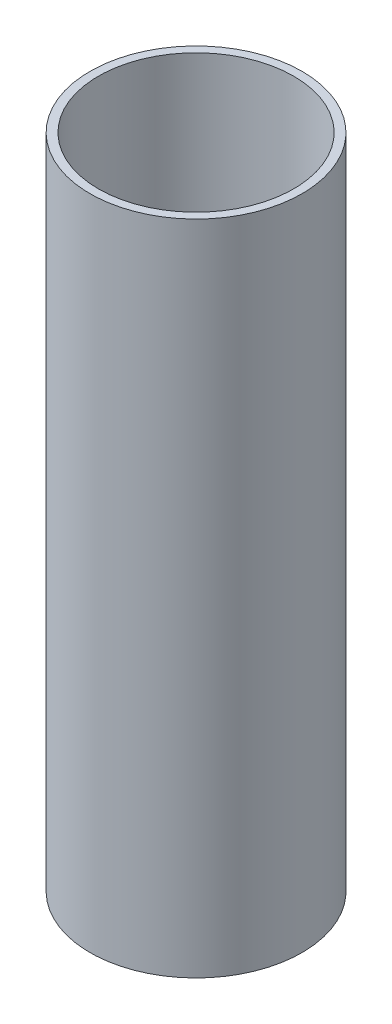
ISO-10303-21;
HEADER;
FILE_DESCRIPTION(('STEP AP214'),'2;1');
FILE_NAME('part.step','',(''),(''),'','','');
FILE_SCHEMA(('AUTOMOTIVE_DESIGN { 1 0 10303 214 1 1 1 1 }'));
ENDSEC;
DATA;
#1=APPLICATION_CONTEXT('core data for automotive mechanical design processes');
#2=APPLICATION_PROTOCOL_DEFINITION('international standard','automotive_design',2000,#1);
#3=PRODUCT_CONTEXT('',#1,'mechanical');
#4=PRODUCT('Part','Part','',(#3));
#5=PRODUCT_RELATED_PRODUCT_CATEGORY('part','',(#4));
#6=PRODUCT_DEFINITION_FORMATION('','',#4);
#7=PRODUCT_DEFINITION_CONTEXT('part definition',#1,'design');
#8=PRODUCT_DEFINITION('design','',#6,#7);
#9=PRODUCT_DEFINITION_SHAPE('','',#8);
#10=(LENGTH_UNIT() NAMED_UNIT(*) SI_UNIT(.MILLI.,.METRE.));
#11=(NAMED_UNIT(*) PLANE_ANGLE_UNIT() SI_UNIT($,.RADIAN.));
#12=(NAMED_UNIT(*) SI_UNIT($,.STERADIAN.) SOLID_ANGLE_UNIT());
#13=UNCERTAINTY_MEASURE_WITH_UNIT(LENGTH_MEASURE(1.E-05),#10,'distance_accuracy_value','');
#14=(GEOMETRIC_REPRESENTATION_CONTEXT(3) GLOBAL_UNCERTAINTY_ASSIGNED_CONTEXT((#13)) GLOBAL_UNIT_ASSIGNED_CONTEXT((#10,
#11,#12)) REPRESENTATION_CONTEXT('',''));
#15=CARTESIAN_POINT('',(0.,0.,0.));
#16=DIRECTION('',(0.,0.,1.));
#17=DIRECTION('',(1.,0.,0.));
#18=AXIS2_PLACEMENT_3D('',#15,#16,#17);
#19=CARTESIAN_POINT('',(0.,234.608624,0.));
#20=DIRECTION('',(0.,1.,0.));
#21=DIRECTION('',(0.,0.,1.));
#22=AXIS2_PLACEMENT_3D('',#19,#20,#21);
#23=PLANE('',#22);
#24=CARTESIAN_POINT('',(0.,234.608624,0.));
#25=DIRECTION('',(0.,1.,0.));
#26=DIRECTION('',(0.,0.,1.));
#27=AXIS2_PLACEMENT_3D('',#24,#25,#26);
#28=CIRCLE('',#27,37.846);
#29=CARTESIAN_POINT('',(0.,234.608624,-37.846));
#30=VERTEX_POINT('',#29);
#31=EDGE_CURVE('E10',#30,#30,#28,.T.);
#32=ORIENTED_EDGE('',*,*,#31,.T.);
#33=EDGE_LOOP('',(#32));
#34=FACE_BOUND('',#33,.T.);
#35=CARTESIAN_POINT('',(0.,234.608624,0.));
#36=DIRECTION('',(0.,1.,0.));
#37=DIRECTION('',(0.,0.,1.));
#38=AXIS2_PLACEMENT_3D('',#35,#36,#37);
#39=CIRCLE('',#38,34.8615);
#40=CARTESIAN_POINT('',(0.,234.608624,-34.8615));
#41=VERTEX_POINT('',#40);
#42=EDGE_CURVE('E55',#41,#41,#39,.T.);
#43=ORIENTED_EDGE('',*,*,#42,.F.);
#44=EDGE_LOOP('',(#43));
#45=FACE_BOUND('',#44,.T.);
#46=ADVANCED_FACE('F42',(#34,#45),#23,.T.);
#47=CARTESIAN_POINT('',(0.,0.,0.));
#48=DIRECTION('',(0.,1.,0.));
#49=DIRECTION('',(0.,0.,1.));
#50=AXIS2_PLACEMENT_3D('',#47,#48,#49);
#51=PLANE('',#50);
#52=CARTESIAN_POINT('',(0.,0.,0.));
#53=DIRECTION('',(0.,1.,0.));
#54=DIRECTION('',(0.,0.,1.));
#55=AXIS2_PLACEMENT_3D('',#52,#53,#54);
#56=CIRCLE('',#55,37.846);
#57=CARTESIAN_POINT('',(0.,0.,-37.846));
#58=VERTEX_POINT('',#57);
#59=EDGE_CURVE('E46',#58,#58,#56,.T.);
#60=ORIENTED_EDGE('',*,*,#59,.F.);
#61=EDGE_LOOP('',(#60));
#62=FACE_BOUND('',#61,.T.);
#63=CARTESIAN_POINT('',(0.,0.,0.));
#64=DIRECTION('',(0.,1.,0.));
#65=DIRECTION('',(0.,0.,1.));
#66=AXIS2_PLACEMENT_3D('',#63,#64,#65);
#67=CIRCLE('',#66,34.8615);
#68=CARTESIAN_POINT('',(0.,0.,-34.8615));
#69=VERTEX_POINT('',#68);
#70=EDGE_CURVE('E57',#69,#69,#67,.T.);
#71=ORIENTED_EDGE('',*,*,#70,.T.);
#72=EDGE_LOOP('',(#71));
#73=FACE_BOUND('',#72,.T.);
#74=ADVANCED_FACE('F69',(#62,#73),#51,.F.);
#75=CARTESIAN_POINT('',(0.,234.608624,0.));
#76=DIRECTION('',(0.,-1.,0.));
#77=DIRECTION('',(0.,0.,-1.));
#78=AXIS2_PLACEMENT_3D('',#75,#76,#77);
#79=CYLINDRICAL_SURFACE('',#78,37.846);
#80=CARTESIAN_POINT('',(0.,234.608624,-37.846));
#81=CARTESIAN_POINT('',(0.,232.164784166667,-37.846));
#82=CARTESIAN_POINT('',(0.,229.720944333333,-37.846));
#83=CARTESIAN_POINT('',(0.,224.833264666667,-37.846));
#84=CARTESIAN_POINT('',(0.,222.389424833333,-37.846));
#85=CARTESIAN_POINT('',(0.,217.501745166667,-37.846));
#86=CARTESIAN_POINT('',(0.,215.057905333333,-37.846));
#87=CARTESIAN_POINT('',(0.,210.170225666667,-37.846));
#88=CARTESIAN_POINT('',(0.,207.726385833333,-37.846));
#89=CARTESIAN_POINT('',(0.,202.838706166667,-37.846));
#90=CARTESIAN_POINT('',(0.,200.394866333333,-37.846));
#91=CARTESIAN_POINT('',(0.,195.507186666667,-37.846));
#92=CARTESIAN_POINT('',(0.,193.063346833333,-37.846));
#93=CARTESIAN_POINT('',(0.,188.175667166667,-37.846));
#94=CARTESIAN_POINT('',(0.,185.731827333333,-37.846));
#95=CARTESIAN_POINT('',(0.,180.844147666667,-37.846));
#96=CARTESIAN_POINT('',(0.,178.400307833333,-37.846));
#97=CARTESIAN_POINT('',(0.,173.512628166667,-37.846));
#98=CARTESIAN_POINT('',(0.,171.068788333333,-37.846));
#99=CARTESIAN_POINT('',(0.,166.181108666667,-37.846));
#100=CARTESIAN_POINT('',(0.,163.737268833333,-37.846));
#101=CARTESIAN_POINT('',(0.,158.849589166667,-37.846));
#102=CARTESIAN_POINT('',(0.,156.405749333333,-37.846));
#103=CARTESIAN_POINT('',(0.,151.518069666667,-37.846));
#104=CARTESIAN_POINT('',(0.,149.074229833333,-37.846));
#105=CARTESIAN_POINT('',(0.,144.186550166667,-37.846));
#106=CARTESIAN_POINT('',(0.,141.742710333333,-37.846));
#107=CARTESIAN_POINT('',(0.,136.855030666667,-37.846));
#108=CARTESIAN_POINT('',(0.,134.411190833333,-37.846));
#109=CARTESIAN_POINT('',(0.,129.523511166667,-37.846));
#110=CARTESIAN_POINT('',(0.,127.079671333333,-37.846));
#111=CARTESIAN_POINT('',(0.,122.191991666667,-37.846));
#112=CARTESIAN_POINT('',(0.,119.748151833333,-37.846));
#113=CARTESIAN_POINT('',(0.,114.860472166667,-37.846));
#114=CARTESIAN_POINT('',(0.,112.416632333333,-37.846));
#115=CARTESIAN_POINT('',(0.,107.528952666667,-37.846));
#116=CARTESIAN_POINT('',(0.,105.085112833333,-37.846));
#117=CARTESIAN_POINT('',(0.,100.197433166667,-37.846));
#118=CARTESIAN_POINT('',(0.,97.7535933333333,-37.846));
#119=CARTESIAN_POINT('',(0.,92.8659136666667,-37.846));
#120=CARTESIAN_POINT('',(0.,90.4220738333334,-37.846));
#121=CARTESIAN_POINT('',(0.,85.5343941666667,-37.846));
#122=CARTESIAN_POINT('',(0.,83.0905543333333,-37.846));
#123=CARTESIAN_POINT('',(0.,78.2028746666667,-37.846));
#124=CARTESIAN_POINT('',(0.,75.7590348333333,-37.846));
#125=CARTESIAN_POINT('',(0.,70.8713551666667,-37.846));
#126=CARTESIAN_POINT('',(0.,68.4275153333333,-37.846));
#127=CARTESIAN_POINT('',(0.,63.5398356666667,-37.846));
#128=CARTESIAN_POINT('',(0.,61.0959958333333,-37.846));
#129=CARTESIAN_POINT('',(0.,56.2083161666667,-37.846));
#130=CARTESIAN_POINT('',(0.,53.7644763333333,-37.846));
#131=CARTESIAN_POINT('',(0.,48.8767966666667,-37.846));
#132=CARTESIAN_POINT('',(0.,46.4329568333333,-37.846));
#133=CARTESIAN_POINT('',(0.,41.5452771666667,-37.846));
#134=CARTESIAN_POINT('',(0.,39.1014373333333,-37.846));
#135=CARTESIAN_POINT('',(0.,34.2137576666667,-37.846));
#136=CARTESIAN_POINT('',(0.,31.7699178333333,-37.846));
#137=CARTESIAN_POINT('',(0.,26.8822381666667,-37.846));
#138=CARTESIAN_POINT('',(0.,24.4383983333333,-37.846));
#139=CARTESIAN_POINT('',(0.,19.5507186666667,-37.846));
#140=CARTESIAN_POINT('',(0.,17.1068788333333,-37.846));
#141=CARTESIAN_POINT('',(0.,12.2191991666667,-37.846));
#142=CARTESIAN_POINT('',(0.,9.77535933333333,-37.846));
#143=CARTESIAN_POINT('',(0.,4.88767966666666,-37.846));
#144=CARTESIAN_POINT('',(0.,2.44383983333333,-37.846));
#145=CARTESIAN_POINT('',(0.,0.,-37.846));
#146=B_SPLINE_CURVE_WITH_KNOTS('',3,(#80,#81,#82,#83,#84,#85,#86,#87,#88,#89,#90,#91,#92,#93,
#94,#95,#96,#97,#98,#99,#100,#101,#102,#103,#104,#105,#106,#107,#108,#109,#110,#111,#112,#113,
#114,#115,#116,#117,#118,#119,#120,#121,#122,#123,#124,#125,#126,#127,#128,#129,#130,#131,#132,
#133,#134,#135,#136,#137,#138,#139,#140,#141,#142,#143,#144,#145),.UNSPECIFIED.,.F.,.F.,(4,2,2,
2,2,2,2,2,2,2,2,2,2,2,2,2,2,2,2,2,2,2,2,2,2,2,2,2,2,2,2,2,4),(0.,7.33151949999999,14.663039,
21.9945585,29.326078,36.6575975,43.989117,51.3206365,58.652156,65.9836755,73.315195,80.6467145,
87.978234,95.3097535,102.641273,109.9727925,117.304312,124.6358315,131.967351,139.2988705,
146.63039,153.9619095,161.293429,168.6249485,175.956468,183.2879875,190.619507,197.9510265,
205.282546,212.6140655,219.945585,227.2771045,234.608624),.UNSPECIFIED.);
#147=EDGE_CURVE('BSEAM44',#30,#58,#146,.T.);
#148=ORIENTED_EDGE('',*,*,#31,.F.);
#149=ORIENTED_EDGE('',*,*,#59,.T.);
#150=ORIENTED_EDGE('',*,*,#147,.T.);
#151=ORIENTED_EDGE('',*,*,#147,.F.);
#152=EDGE_LOOP('',(#148,#150,#149,#151));
#153=FACE_BOUND('',#152,.T.);
#154=ADVANCED_FACE('F44',(#153),#79,.T.);
#155=CARTESIAN_POINT('',(0.,234.608624,0.));
#156=DIRECTION('',(0.,-1.,0.));
#157=DIRECTION('',(0.,0.,-1.));
#158=AXIS2_PLACEMENT_3D('',#155,#156,#157);
#159=CYLINDRICAL_SURFACE('',#158,34.8615);
#160=CARTESIAN_POINT('',(0.,234.608624,-34.8615));
#161=CARTESIAN_POINT('',(0.,232.164784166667,-34.8615));
#162=CARTESIAN_POINT('',(0.,229.720944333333,-34.8615));
#163=CARTESIAN_POINT('',(0.,224.833264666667,-34.8615));
#164=CARTESIAN_POINT('',(0.,222.389424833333,-34.8615));
#165=CARTESIAN_POINT('',(0.,217.501745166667,-34.8615));
#166=CARTESIAN_POINT('',(0.,215.057905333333,-34.8615));
#167=CARTESIAN_POINT('',(0.,210.170225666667,-34.8615));
#168=CARTESIAN_POINT('',(0.,207.726385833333,-34.8615));
#169=CARTESIAN_POINT('',(0.,202.838706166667,-34.8615));
#170=CARTESIAN_POINT('',(0.,200.394866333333,-34.8615));
#171=CARTESIAN_POINT('',(0.,195.507186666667,-34.8615));
#172=CARTESIAN_POINT('',(0.,193.063346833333,-34.8615));
#173=CARTESIAN_POINT('',(0.,188.175667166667,-34.8615));
#174=CARTESIAN_POINT('',(0.,185.731827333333,-34.8615));
#175=CARTESIAN_POINT('',(0.,180.844147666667,-34.8615));
#176=CARTESIAN_POINT('',(0.,178.400307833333,-34.8615));
#177=CARTESIAN_POINT('',(0.,173.512628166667,-34.8615));
#178=CARTESIAN_POINT('',(0.,171.068788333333,-34.8615));
#179=CARTESIAN_POINT('',(0.,166.181108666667,-34.8615));
#180=CARTESIAN_POINT('',(0.,163.737268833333,-34.8615));
#181=CARTESIAN_POINT('',(0.,158.849589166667,-34.8615));
#182=CARTESIAN_POINT('',(0.,156.405749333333,-34.8615));
#183=CARTESIAN_POINT('',(0.,151.518069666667,-34.8615));
#184=CARTESIAN_POINT('',(0.,149.074229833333,-34.8615));
#185=CARTESIAN_POINT('',(0.,144.186550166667,-34.8615));
#186=CARTESIAN_POINT('',(0.,141.742710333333,-34.8615));
#187=CARTESIAN_POINT('',(0.,136.855030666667,-34.8615));
#188=CARTESIAN_POINT('',(0.,134.411190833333,-34.8615));
#189=CARTESIAN_POINT('',(0.,129.523511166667,-34.8615));
#190=CARTESIAN_POINT('',(0.,127.079671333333,-34.8615));
#191=CARTESIAN_POINT('',(0.,122.191991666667,-34.8615));
#192=CARTESIAN_POINT('',(0.,119.748151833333,-34.8615));
#193=CARTESIAN_POINT('',(0.,114.860472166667,-34.8615));
#194=CARTESIAN_POINT('',(0.,112.416632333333,-34.8615));
#195=CARTESIAN_POINT('',(0.,107.528952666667,-34.8615));
#196=CARTESIAN_POINT('',(0.,105.085112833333,-34.8615));
#197=CARTESIAN_POINT('',(0.,100.197433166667,-34.8615));
#198=CARTESIAN_POINT('',(0.,97.7535933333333,-34.8615));
#199=CARTESIAN_POINT('',(0.,92.8659136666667,-34.8615));
#200=CARTESIAN_POINT('',(0.,90.4220738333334,-34.8615));
#201=CARTESIAN_POINT('',(0.,85.5343941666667,-34.8615));
#202=CARTESIAN_POINT('',(0.,83.0905543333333,-34.8615));
#203=CARTESIAN_POINT('',(0.,78.2028746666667,-34.8615));
#204=CARTESIAN_POINT('',(0.,75.7590348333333,-34.8615));
#205=CARTESIAN_POINT('',(0.,70.8713551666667,-34.8615));
#206=CARTESIAN_POINT('',(0.,68.4275153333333,-34.8615));
#207=CARTESIAN_POINT('',(0.,63.5398356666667,-34.8615));
#208=CARTESIAN_POINT('',(0.,61.0959958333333,-34.8615));
#209=CARTESIAN_POINT('',(0.,56.2083161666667,-34.8615));
#210=CARTESIAN_POINT('',(0.,53.7644763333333,-34.8615));
#211=CARTESIAN_POINT('',(0.,48.8767966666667,-34.8615));
#212=CARTESIAN_POINT('',(0.,46.4329568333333,-34.8615));
#213=CARTESIAN_POINT('',(0.,41.5452771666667,-34.8615));
#214=CARTESIAN_POINT('',(0.,39.1014373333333,-34.8615));
#215=CARTESIAN_POINT('',(0.,34.2137576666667,-34.8615));
#216=CARTESIAN_POINT('',(0.,31.7699178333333,-34.8615));
#217=CARTESIAN_POINT('',(0.,26.8822381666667,-34.8615));
#218=CARTESIAN_POINT('',(0.,24.4383983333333,-34.8615));
#219=CARTESIAN_POINT('',(0.,19.5507186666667,-34.8615));
#220=CARTESIAN_POINT('',(0.,17.1068788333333,-34.8615));
#221=CARTESIAN_POINT('',(0.,12.2191991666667,-34.8615));
#222=CARTESIAN_POINT('',(0.,9.77535933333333,-34.8615));
#223=CARTESIAN_POINT('',(0.,4.88767966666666,-34.8615));
#224=CARTESIAN_POINT('',(0.,2.44383983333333,-34.8615));
#225=CARTESIAN_POINT('',(0.,0.,-34.8615));
#226=B_SPLINE_CURVE_WITH_KNOTS('',3,(#160,#161,#162,#163,#164,#165,#166,#167,#168,#169,#170,
#171,#172,#173,#174,#175,#176,#177,#178,#179,#180,#181,#182,#183,#184,#185,#186,#187,#188,#189,
#190,#191,#192,#193,#194,#195,#196,#197,#198,#199,#200,#201,#202,#203,#204,#205,#206,#207,#208,
#209,#210,#211,#212,#213,#214,#215,#216,#217,#218,#219,#220,#221,#222,#223,#224,#225),
.UNSPECIFIED.,.F.,.F.,(4,2,2,2,2,2,2,2,2,2,2,2,2,2,2,2,2,2,2,2,2,2,2,2,2,2,2,2,2,2,2,2,4),(0.,
7.33151949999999,14.663039,21.9945585,29.326078,36.6575975,43.989117,51.3206365,58.652156,
65.9836755,73.315195,80.6467145,87.978234,95.3097535,102.641273,109.9727925,117.304312,
124.6358315,131.967351,139.2988705,146.63039,153.9619095,161.293429,168.6249485,175.956468,
183.2879875,190.619507,197.9510265,205.282546,212.6140655,219.945585,227.2771045,234.608624),.UNSPECIFIED.);
#227=EDGE_CURVE('BSEAM65',#41,#69,#226,.T.);
#228=ORIENTED_EDGE('',*,*,#42,.T.);
#229=ORIENTED_EDGE('',*,*,#70,.F.);
#230=ORIENTED_EDGE('',*,*,#227,.T.);
#231=ORIENTED_EDGE('',*,*,#227,.F.);
#232=EDGE_LOOP('',(#228,#230,#229,#231));
#233=FACE_BOUND('',#232,.T.);
#234=ADVANCED_FACE('F65',(#233),#159,.F.);
#235=CLOSED_SHELL('',(#46,#74,#154,#234));
#236=MANIFOLD_SOLID_BREP('B2',#235);
#237=ADVANCED_BREP_SHAPE_REPRESENTATION('',(#18,#236),#14);
#238=SHAPE_DEFINITION_REPRESENTATION(#9,#237);
ENDSEC;
END-ISO-10303-21;
